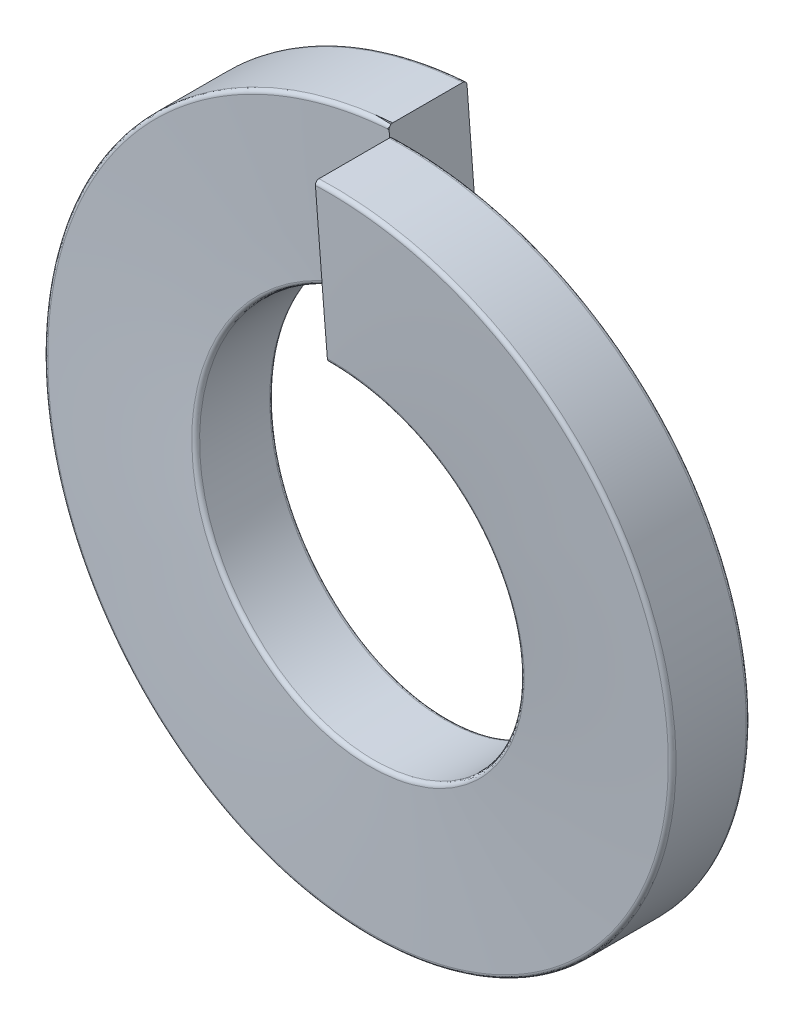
from build123d import *

# Parameters (mm, degrees)
SWEEP1_PITCH            = 0.5588
SWEEP1_HEIGHT           = 0.5588
SWEEP1_RADIUS           = 2.1844
SWEEP1_START_ANGLE      = 90
SKETCH4_W               = 0.508
SKETCH4_H               = 0.9906
FILLET1_R               = 0.0254
CUT_EXTRUDE1_DEPTH      = 4.139350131
CUT_EXTRUDE1_DEPTH_BACK = 4.139350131


with BuildPart() as part:
    # Sweep1: sweep along a helix
    with BuildLine() as sweep1_path:
        add(Helix(SWEEP1_PITCH, SWEEP1_HEIGHT, SWEEP1_RADIUS, center=(0, 0, -0.5588), direction=(0, 0, 1), mode=Mode.PRIVATE).rotate(Axis((0, 0, -0.5588), (0, 0, 1)), SWEEP1_START_ANGLE))
    # Sketch4 → Sweep1 (sweep)
    with BuildSketch(Plane(origin=(0, 0, 0), x_dir=(0, 0, -1), z_dir=(1, 0, 0))):
        with Locations((0.3048, 1.6891)):
            Rectangle(SKETCH4_W, SKETCH4_H)
    sweep(path=sweep1_path.line, is_frenet=True)

    # Fillet1
    fillet1_edges = [part.edges().sort_by_distance(p)[0] for p in [
        (0, -2.184397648, 0.2286),
        (0, -1.193798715, 0.2286),
        (0, -1.193798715, -0.2794),
        (0, -2.184397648, -0.2794),
    ]]
    fillet(fillet1_edges, radius=FILLET1_R)

    # Sketch5 → Cut-Extrude1 (cut, two sides: drawn at the far end of the back side and taken through both)
    with BuildSketch(Plane.XY.offset(-CUT_EXTRUDE1_DEPTH_BACK)):
        with BuildLine():
            Line((0, 2.1844), (0.076526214, 1.191344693))
            Line((0.076526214, 1.191344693), (0.076526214, 0))
            Line((0.076526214, 0), (0, 0))
            Line((0, 0), (0, 1.1938))
            Line((0, 1.1938), (-0.076234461, 2.183069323))
            ThreePointArc((-0.076234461, 2.183069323), (-0.038123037, 2.184067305), (0, 2.1844))
        make_face()
    extrude(amount=CUT_EXTRUDE1_DEPTH + CUT_EXTRUDE1_DEPTH_BACK, mode=Mode.SUBTRACT)


solid = part.part
